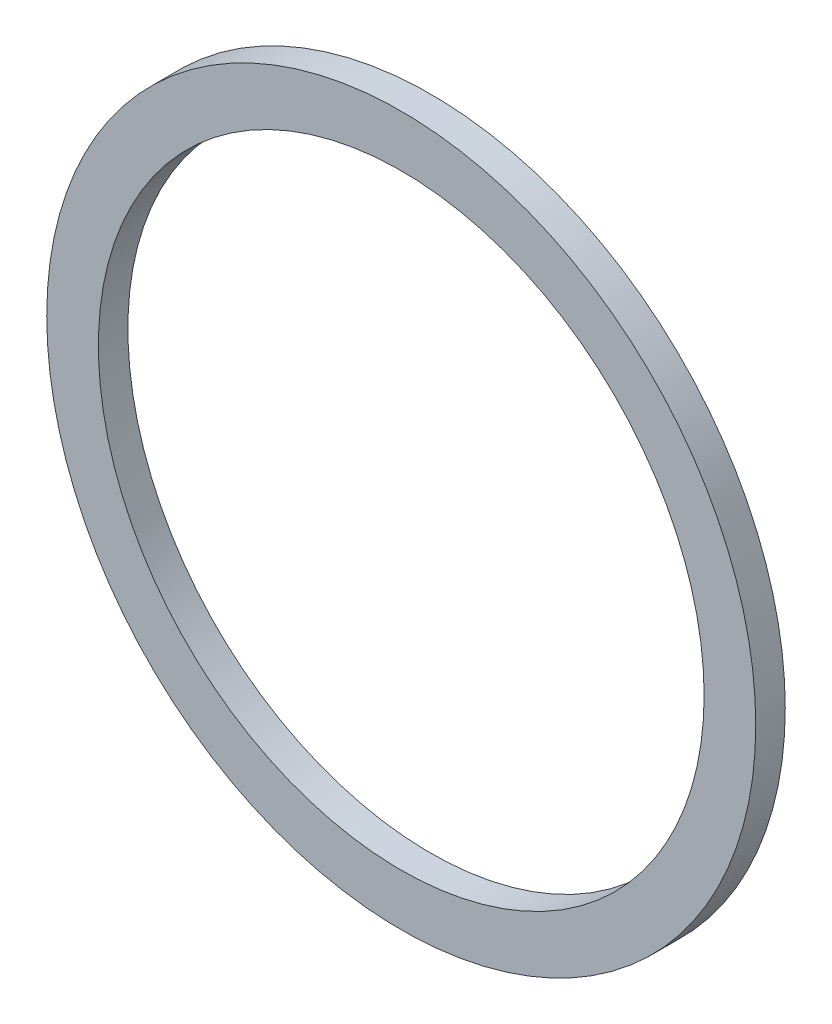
ISO-10303-21;
HEADER;
FILE_DESCRIPTION(('STEP AP214'),'2;1');
FILE_NAME('part.step','',(''),(''),'','','');
FILE_SCHEMA(('AUTOMOTIVE_DESIGN { 1 0 10303 214 1 1 1 1 }'));
ENDSEC;
DATA;
#1=APPLICATION_CONTEXT('core data for automotive mechanical design processes');
#2=APPLICATION_PROTOCOL_DEFINITION('international standard','automotive_design',2000,#1);
#3=PRODUCT_CONTEXT('',#1,'mechanical');
#4=PRODUCT('Part','Part','',(#3));
#5=PRODUCT_RELATED_PRODUCT_CATEGORY('part','',(#4));
#6=PRODUCT_DEFINITION_FORMATION('','',#4);
#7=PRODUCT_DEFINITION_CONTEXT('part definition',#1,'design');
#8=PRODUCT_DEFINITION('design','',#6,#7);
#9=PRODUCT_DEFINITION_SHAPE('','',#8);
#10=(LENGTH_UNIT() NAMED_UNIT(*) SI_UNIT(.MILLI.,.METRE.));
#11=(NAMED_UNIT(*) PLANE_ANGLE_UNIT() SI_UNIT($,.RADIAN.));
#12=(NAMED_UNIT(*) SI_UNIT($,.STERADIAN.) SOLID_ANGLE_UNIT());
#13=UNCERTAINTY_MEASURE_WITH_UNIT(LENGTH_MEASURE(1.E-05),#10,'distance_accuracy_value','');
#14=(GEOMETRIC_REPRESENTATION_CONTEXT(3) GLOBAL_UNCERTAINTY_ASSIGNED_CONTEXT((#13)) GLOBAL_UNIT_ASSIGNED_CONTEXT((#10,
#11,#12)) REPRESENTATION_CONTEXT('',''));
#15=CARTESIAN_POINT('',(0.,0.,0.));
#16=DIRECTION('',(0.,0.,1.));
#17=DIRECTION('',(1.,0.,0.));
#18=AXIS2_PLACEMENT_3D('',#15,#16,#17);
#19=CARTESIAN_POINT('',(0.,0.,1.6));
#20=DIRECTION('',(0.,0.,1.));
#21=DIRECTION('',(1.,0.,0.));
#22=AXIS2_PLACEMENT_3D('',#19,#20,#21);
#23=PLANE('',#22);
#24=CARTESIAN_POINT('',(0.,0.,1.6));
#25=DIRECTION('',(0.,0.,1.));
#26=DIRECTION('',(1.,0.,0.));
#27=AXIS2_PLACEMENT_3D('',#24,#25,#26);
#28=CIRCLE('',#27,19.225);
#29=CARTESIAN_POINT('',(19.225,0.,1.6));
#30=VERTEX_POINT('',#29);
#31=EDGE_CURVE('E10',#30,#30,#28,.T.);
#32=ORIENTED_EDGE('',*,*,#31,.T.);
#33=EDGE_LOOP('',(#32));
#34=FACE_BOUND('',#33,.T.);
#35=CARTESIAN_POINT('',(0.,0.,1.6));
#36=DIRECTION('',(0.,0.,1.));
#37=DIRECTION('',(1.,0.,0.));
#38=AXIS2_PLACEMENT_3D('',#35,#36,#37);
#39=CIRCLE('',#38,16.425);
#40=CARTESIAN_POINT('',(16.425,0.,1.6));
#41=VERTEX_POINT('',#40);
#42=EDGE_CURVE('E48',#41,#41,#39,.T.);
#43=ORIENTED_EDGE('',*,*,#42,.F.);
#44=EDGE_LOOP('',(#43));
#45=FACE_BOUND('',#44,.T.);
#46=ADVANCED_FACE('F35',(#34,#45),#23,.T.);
#47=CARTESIAN_POINT('',(0.,0.,0.));
#48=DIRECTION('',(0.,0.,1.));
#49=DIRECTION('',(1.,0.,0.));
#50=AXIS2_PLACEMENT_3D('',#47,#48,#49);
#51=PLANE('',#50);
#52=CARTESIAN_POINT('',(0.,0.,0.));
#53=DIRECTION('',(0.,0.,1.));
#54=DIRECTION('',(1.,0.,0.));
#55=AXIS2_PLACEMENT_3D('',#52,#53,#54);
#56=CIRCLE('',#55,19.225);
#57=CARTESIAN_POINT('',(19.225,0.,0.));
#58=VERTEX_POINT('',#57);
#59=EDGE_CURVE('E39',#58,#58,#56,.T.);
#60=ORIENTED_EDGE('',*,*,#59,.F.);
#61=EDGE_LOOP('',(#60));
#62=FACE_BOUND('',#61,.T.);
#63=CARTESIAN_POINT('',(0.,0.,0.));
#64=DIRECTION('',(0.,0.,1.));
#65=DIRECTION('',(1.,0.,0.));
#66=AXIS2_PLACEMENT_3D('',#63,#64,#65);
#67=CIRCLE('',#66,16.425);
#68=CARTESIAN_POINT('',(16.425,0.,0.));
#69=VERTEX_POINT('',#68);
#70=EDGE_CURVE('E50',#69,#69,#67,.T.);
#71=ORIENTED_EDGE('',*,*,#70,.T.);
#72=EDGE_LOOP('',(#71));
#73=FACE_BOUND('',#72,.T.);
#74=ADVANCED_FACE('F62',(#62,#73),#51,.F.);
#75=CARTESIAN_POINT('',(0.,0.,1.6));
#76=DIRECTION('',(0.,0.,-1.));
#77=DIRECTION('',(-1.,0.,0.));
#78=AXIS2_PLACEMENT_3D('',#75,#76,#77);
#79=CYLINDRICAL_SURFACE('',#78,19.225);
#80=ORIENTED_EDGE('',*,*,#31,.F.);
#81=EDGE_LOOP('',(#80));
#82=FACE_BOUND('',#81,.T.);
#83=ORIENTED_EDGE('',*,*,#59,.T.);
#84=EDGE_LOOP('',(#83));
#85=FACE_BOUND('',#84,.T.);
#86=ADVANCED_FACE('F37',(#82,#85),#79,.T.);
#87=CARTESIAN_POINT('',(0.,0.,1.6));
#88=DIRECTION('',(0.,0.,-1.));
#89=DIRECTION('',(-1.,0.,0.));
#90=AXIS2_PLACEMENT_3D('',#87,#88,#89);
#91=CYLINDRICAL_SURFACE('',#90,16.425);
#92=ORIENTED_EDGE('',*,*,#42,.T.);
#93=EDGE_LOOP('',(#92));
#94=FACE_BOUND('',#93,.T.);
#95=ORIENTED_EDGE('',*,*,#70,.F.);
#96=EDGE_LOOP('',(#95));
#97=FACE_BOUND('',#96,.T.);
#98=ADVANCED_FACE('F58',(#94,#97),#91,.F.);
#99=CLOSED_SHELL('',(#46,#74,#86,#98));
#100=MANIFOLD_SOLID_BREP('B2',#99);
#101=ADVANCED_BREP_SHAPE_REPRESENTATION('',(#18,#100),#14);
#102=SHAPE_DEFINITION_REPRESENTATION(#9,#101);
ENDSEC;
END-ISO-10303-21;
